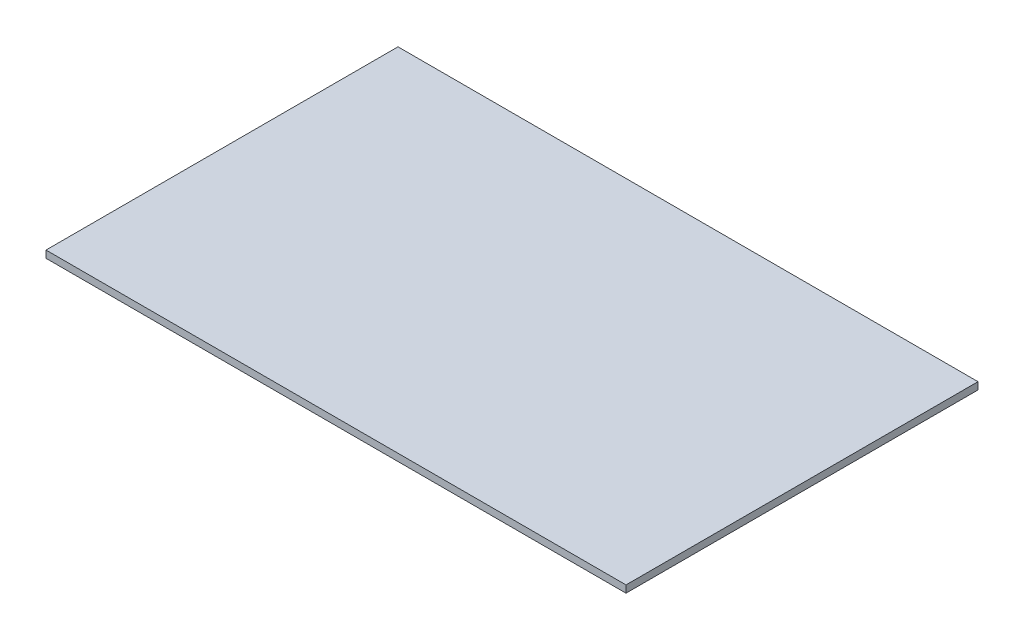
ISO-10303-21;
HEADER;
FILE_DESCRIPTION(('STEP AP214'),'2;1');
FILE_NAME('part.step','',(''),(''),'','','');
FILE_SCHEMA(('AUTOMOTIVE_DESIGN { 1 0 10303 214 1 1 1 1 }'));
ENDSEC;
DATA;
#1=APPLICATION_CONTEXT('core data for automotive mechanical design processes');
#2=APPLICATION_PROTOCOL_DEFINITION('international standard','automotive_design',2000,#1);
#3=PRODUCT_CONTEXT('',#1,'mechanical');
#4=PRODUCT('Part','Part','',(#3));
#5=PRODUCT_RELATED_PRODUCT_CATEGORY('part','',(#4));
#6=PRODUCT_DEFINITION_FORMATION('','',#4);
#7=PRODUCT_DEFINITION_CONTEXT('part definition',#1,'design');
#8=PRODUCT_DEFINITION('design','',#6,#7);
#9=PRODUCT_DEFINITION_SHAPE('','',#8);
#10=(LENGTH_UNIT() NAMED_UNIT(*) SI_UNIT(.MILLI.,.METRE.));
#11=(NAMED_UNIT(*) PLANE_ANGLE_UNIT() SI_UNIT($,.RADIAN.));
#12=(NAMED_UNIT(*) SI_UNIT($,.STERADIAN.) SOLID_ANGLE_UNIT());
#13=UNCERTAINTY_MEASURE_WITH_UNIT(LENGTH_MEASURE(1.E-05),#10,'distance_accuracy_value','');
#14=(GEOMETRIC_REPRESENTATION_CONTEXT(3) GLOBAL_UNCERTAINTY_ASSIGNED_CONTEXT((#13)) GLOBAL_UNIT_ASSIGNED_CONTEXT((#10,
#11,#12)) REPRESENTATION_CONTEXT('',''));
#15=CARTESIAN_POINT('',(0.,0.,0.));
#16=DIRECTION('',(0.,0.,1.));
#17=DIRECTION('',(1.,0.,0.));
#18=AXIS2_PLACEMENT_3D('',#15,#16,#17);
#19=CARTESIAN_POINT('',(0.,12.7,0.));
#20=DIRECTION('',(1.,0.,0.));
#21=DIRECTION('',(0.,0.,-1.));
#22=AXIS2_PLACEMENT_3D('',#19,#20,#21);
#23=PLANE('',#22);
#24=DIRECTION('',(0.,0.,1.));
#25=VECTOR('',#24,1.);
#26=CARTESIAN_POINT('',(0.,0.,0.));
#27=LINE('',#26,#25);
#28=CARTESIAN_POINT('',(0.,0.,-622.3));
#29=VERTEX_POINT('',#28);
#30=CARTESIAN_POINT('',(0.,0.,0.));
#31=VERTEX_POINT('',#30);
#32=EDGE_CURVE('E93',#29,#31,#27,.T.);
#33=ORIENTED_EDGE('',*,*,#32,.T.);
#34=DIRECTION('',(0.,-1.,0.));
#35=VECTOR('',#34,1.);
#36=CARTESIAN_POINT('',(0.,12.7,0.));
#37=LINE('',#36,#35);
#38=CARTESIAN_POINT('',(0.,12.7,0.));
#39=VERTEX_POINT('',#38);
#40=EDGE_CURVE('E11',#39,#31,#37,.T.);
#41=ORIENTED_EDGE('',*,*,#40,.F.);
#42=DIRECTION('',(0.,0.,1.));
#43=VECTOR('',#42,1.);
#44=CARTESIAN_POINT('',(0.,12.7,0.));
#45=LINE('',#44,#43);
#46=CARTESIAN_POINT('',(0.,12.7,-622.3));
#47=VERTEX_POINT('',#46);
#48=EDGE_CURVE('E81',#47,#39,#45,.T.);
#49=ORIENTED_EDGE('',*,*,#48,.F.);
#50=DIRECTION('',(0.,-1.,0.));
#51=VECTOR('',#50,1.);
#52=CARTESIAN_POINT('',(0.,12.7,-622.3));
#53=LINE('',#52,#51);
#54=EDGE_CURVE('E89',#47,#29,#53,.T.);
#55=ORIENTED_EDGE('',*,*,#54,.T.);
#56=EDGE_LOOP('',(#33,#41,#49,#55));
#57=FACE_BOUND('',#56,.T.);
#58=ADVANCED_FACE('F30',(#57),#23,.F.);
#59=CARTESIAN_POINT('',(0.,12.7,0.));
#60=DIRECTION('',(0.,0.,-1.));
#61=DIRECTION('',(-1.,0.,0.));
#62=AXIS2_PLACEMENT_3D('',#59,#60,#61);
#63=PLANE('',#62);
#64=DIRECTION('',(1.,0.,0.));
#65=VECTOR('',#64,1.);
#66=CARTESIAN_POINT('',(0.,0.,0.));
#67=LINE('',#66,#65);
#68=CARTESIAN_POINT('',(1025.398,0.,0.));
#69=VERTEX_POINT('',#68);
#70=EDGE_CURVE('E85',#31,#69,#67,.T.);
#71=ORIENTED_EDGE('',*,*,#70,.T.);
#72=DIRECTION('',(0.,-1.,0.));
#73=VECTOR('',#72,1.);
#74=CARTESIAN_POINT('',(1025.398,12.7,0.));
#75=LINE('',#74,#73);
#76=CARTESIAN_POINT('',(1025.398,12.7,0.));
#77=VERTEX_POINT('',#76);
#78=EDGE_CURVE('E38',#77,#69,#75,.T.);
#79=ORIENTED_EDGE('',*,*,#78,.F.);
#80=DIRECTION('',(1.,0.,0.));
#81=VECTOR('',#80,1.);
#82=CARTESIAN_POINT('',(0.,12.7,0.));
#83=LINE('',#82,#81);
#84=EDGE_CURVE('E76',#39,#77,#83,.T.);
#85=ORIENTED_EDGE('',*,*,#84,.F.);
#86=ORIENTED_EDGE('',*,*,#40,.T.);
#87=EDGE_LOOP('',(#71,#79,#85,#86));
#88=FACE_BOUND('',#87,.T.);
#89=ADVANCED_FACE('F84',(#88),#63,.F.);
#90=CARTESIAN_POINT('',(1025.398,12.7,0.));
#91=DIRECTION('',(-1.,0.,0.));
#92=DIRECTION('',(0.,0.,1.));
#93=AXIS2_PLACEMENT_3D('',#90,#91,#92);
#94=PLANE('',#93);
#95=DIRECTION('',(0.,0.,-1.));
#96=VECTOR('',#95,1.);
#97=CARTESIAN_POINT('',(1025.398,0.,0.));
#98=LINE('',#97,#96);
#99=CARTESIAN_POINT('',(1025.398,0.,-622.3));
#100=VERTEX_POINT('',#99);
#101=EDGE_CURVE('E63',#69,#100,#98,.T.);
#102=ORIENTED_EDGE('',*,*,#101,.T.);
#103=DIRECTION('',(0.,-1.,0.));
#104=VECTOR('',#103,1.);
#105=CARTESIAN_POINT('',(1025.398,12.7,-622.3));
#106=LINE('',#105,#104);
#107=CARTESIAN_POINT('',(1025.398,12.7,-622.3));
#108=VERTEX_POINT('',#107);
#109=EDGE_CURVE('E86',#108,#100,#106,.T.);
#110=ORIENTED_EDGE('',*,*,#109,.F.);
#111=DIRECTION('',(0.,0.,-1.));
#112=VECTOR('',#111,1.);
#113=CARTESIAN_POINT('',(1025.398,12.7,0.));
#114=LINE('',#113,#112);
#115=EDGE_CURVE('E79',#77,#108,#114,.T.);
#116=ORIENTED_EDGE('',*,*,#115,.F.);
#117=ORIENTED_EDGE('',*,*,#78,.T.);
#118=EDGE_LOOP('',(#102,#110,#116,#117));
#119=FACE_BOUND('',#118,.T.);
#120=ADVANCED_FACE('F87',(#119),#94,.F.);
#121=CARTESIAN_POINT('',(0.,12.7,-622.3));
#122=DIRECTION('',(0.,0.,1.));
#123=DIRECTION('',(1.,0.,0.));
#124=AXIS2_PLACEMENT_3D('',#121,#122,#123);
#125=PLANE('',#124);
#126=DIRECTION('',(-1.,0.,0.));
#127=VECTOR('',#126,1.);
#128=CARTESIAN_POINT('',(0.,0.,-622.3));
#129=LINE('',#128,#127);
#130=EDGE_CURVE('E69',#100,#29,#129,.T.);
#131=ORIENTED_EDGE('',*,*,#130,.T.);
#132=ORIENTED_EDGE('',*,*,#54,.F.);
#133=DIRECTION('',(-1.,0.,0.));
#134=VECTOR('',#133,1.);
#135=CARTESIAN_POINT('',(0.,12.7,-622.3));
#136=LINE('',#135,#134);
#137=EDGE_CURVE('E46',#108,#47,#136,.T.);
#138=ORIENTED_EDGE('',*,*,#137,.F.);
#139=ORIENTED_EDGE('',*,*,#109,.T.);
#140=EDGE_LOOP('',(#131,#132,#138,#139));
#141=FACE_BOUND('',#140,.T.);
#142=ADVANCED_FACE('F100',(#141),#125,.F.);
#143=CARTESIAN_POINT('',(0.,12.7,-622.3));
#144=DIRECTION('',(0.,-1.,0.));
#145=DIRECTION('',(0.,0.,-1.));
#146=AXIS2_PLACEMENT_3D('',#143,#144,#145);
#147=PLANE('',#146);
#148=ORIENTED_EDGE('',*,*,#48,.T.);
#149=ORIENTED_EDGE('',*,*,#84,.T.);
#150=ORIENTED_EDGE('',*,*,#115,.T.);
#151=ORIENTED_EDGE('',*,*,#137,.T.);
#152=EDGE_LOOP('',(#148,#149,#150,#151));
#153=FACE_BOUND('',#152,.T.);
#154=ADVANCED_FACE('F77',(#153),#147,.F.);
#155=CARTESIAN_POINT('',(0.,0.,-622.3));
#156=DIRECTION('',(0.,-1.,0.));
#157=DIRECTION('',(0.,0.,-1.));
#158=AXIS2_PLACEMENT_3D('',#155,#156,#157);
#159=PLANE('',#158);
#160=ORIENTED_EDGE('',*,*,#32,.F.);
#161=ORIENTED_EDGE('',*,*,#130,.F.);
#162=ORIENTED_EDGE('',*,*,#101,.F.);
#163=ORIENTED_EDGE('',*,*,#70,.F.);
#164=EDGE_LOOP('',(#160,#161,#162,#163));
#165=FACE_BOUND('',#164,.T.);
#166=ADVANCED_FACE('F103',(#165),#159,.T.);
#167=CLOSED_SHELL('',(#58,#89,#120,#142,#154,#166));
#168=MANIFOLD_SOLID_BREP('B2',#167);
#169=ADVANCED_BREP_SHAPE_REPRESENTATION('',(#18,#168),#14);
#170=SHAPE_DEFINITION_REPRESENTATION(#9,#169);
ENDSEC;
END-ISO-10303-21;
